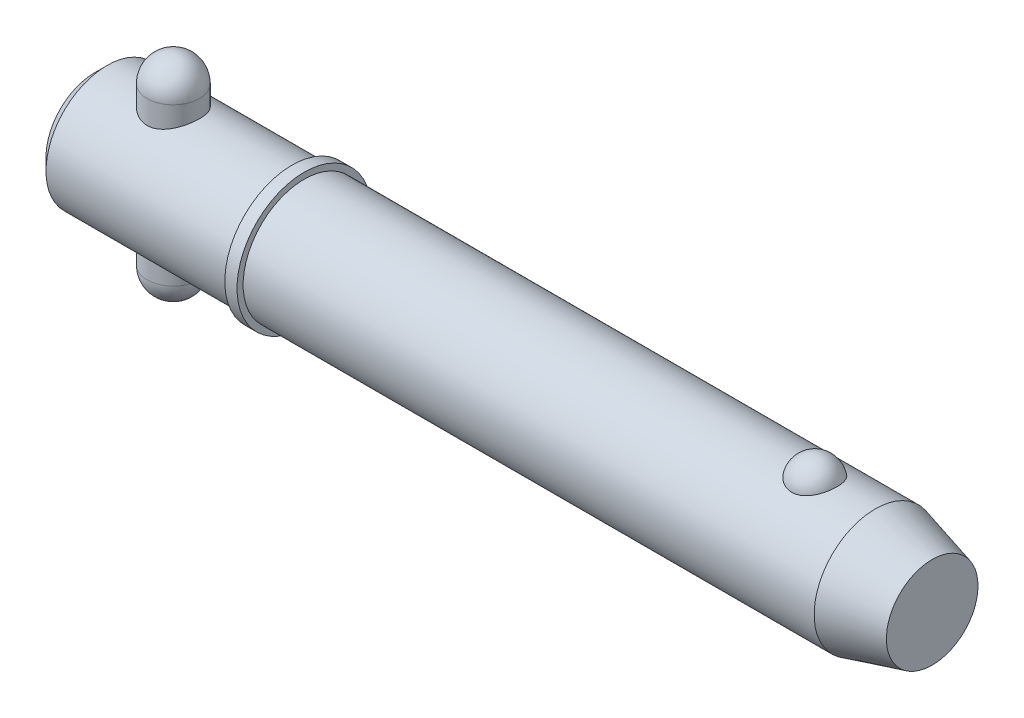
ISO-10303-21;
HEADER;
FILE_DESCRIPTION(('STEP AP214'),'2;1');
FILE_NAME('part.step','',(''),(''),'','','');
FILE_SCHEMA(('AUTOMOTIVE_DESIGN { 1 0 10303 214 1 1 1 1 }'));
ENDSEC;
DATA;
#1=APPLICATION_CONTEXT('core data for automotive mechanical design processes');
#2=APPLICATION_PROTOCOL_DEFINITION('international standard','automotive_design',2000,#1);
#3=PRODUCT_CONTEXT('',#1,'mechanical');
#4=PRODUCT('Part','Part','',(#3));
#5=PRODUCT_RELATED_PRODUCT_CATEGORY('part','',(#4));
#6=PRODUCT_DEFINITION_FORMATION('','',#4);
#7=PRODUCT_DEFINITION_CONTEXT('part definition',#1,'design');
#8=PRODUCT_DEFINITION('design','',#6,#7);
#9=PRODUCT_DEFINITION_SHAPE('','',#8);
#10=(LENGTH_UNIT() NAMED_UNIT(*) SI_UNIT(.MILLI.,.METRE.));
#11=(NAMED_UNIT(*) PLANE_ANGLE_UNIT() SI_UNIT($,.RADIAN.));
#12=(NAMED_UNIT(*) SI_UNIT($,.STERADIAN.) SOLID_ANGLE_UNIT());
#13=UNCERTAINTY_MEASURE_WITH_UNIT(LENGTH_MEASURE(1.E-05),#10,'distance_accuracy_value','');
#14=(GEOMETRIC_REPRESENTATION_CONTEXT(3) GLOBAL_UNCERTAINTY_ASSIGNED_CONTEXT((#13)) GLOBAL_UNIT_ASSIGNED_CONTEXT((#10,
#11,#12)) REPRESENTATION_CONTEXT('',''));
#15=CARTESIAN_POINT('',(0.,0.,0.));
#16=DIRECTION('',(0.,0.,1.));
#17=DIRECTION('',(1.,0.,0.));
#18=AXIS2_PLACEMENT_3D('',#15,#16,#17);
#19=CARTESIAN_POINT('',(14.28,19.05,0.));
#20=DIRECTION('',(0.,-1.,0.));
#21=DIRECTION('',(0.,0.,-1.));
#22=AXIS2_PLACEMENT_3D('',#19,#20,#21);
#23=CYLINDRICAL_SURFACE('',#22,4.76);
#24=CARTESIAN_POINT('',(14.28,-14.29,0.));
#25=DIRECTION('',(0.,-1.,0.));
#26=DIRECTION('',(0.,0.,-1.));
#27=AXIS2_PLACEMENT_3D('',#24,#25,#26);
#28=CIRCLE('',#27,4.76);
#29=CARTESIAN_POINT('',(14.28,-14.29,-4.76));
#30=VERTEX_POINT('',#29);
#31=EDGE_CURVE('P0_E10',#30,#30,#28,.F.);
#32=CARTESIAN_POINT('',(14.28,14.29,0.));
#33=DIRECTION('',(0.,-1.,0.));
#34=DIRECTION('',(0.,0.,-1.));
#35=AXIS2_PLACEMENT_3D('',#32,#33,#34);
#36=CIRCLE('',#35,4.76);
#37=CARTESIAN_POINT('',(14.28,14.29,-4.76));
#38=VERTEX_POINT('',#37);
#39=EDGE_CURVE('P0_E21',#38,#38,#36,.T.);
#40=CARTESIAN_POINT('',(14.28,-14.29,-4.76));
#41=CARTESIAN_POINT('',(14.28,-13.9922916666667,-4.76));
#42=CARTESIAN_POINT('',(14.28,-13.6945833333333,-4.76));
#43=CARTESIAN_POINT('',(14.28,-13.0991666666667,-4.76));
#44=CARTESIAN_POINT('',(14.28,-12.8014583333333,-4.76));
#45=CARTESIAN_POINT('',(14.28,-12.2060416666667,-4.76));
#46=CARTESIAN_POINT('',(14.28,-11.9083333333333,-4.76));
#47=CARTESIAN_POINT('',(14.28,-11.3129166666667,-4.76));
#48=CARTESIAN_POINT('',(14.28,-11.0152083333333,-4.76));
#49=CARTESIAN_POINT('',(14.28,-10.4197916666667,-4.76));
#50=CARTESIAN_POINT('',(14.28,-10.1220833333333,-4.76));
#51=CARTESIAN_POINT('',(14.28,-9.52666666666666,-4.76));
#52=CARTESIAN_POINT('',(14.28,-9.22895833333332,-4.76));
#53=CARTESIAN_POINT('',(14.28,-8.63354166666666,-4.76));
#54=CARTESIAN_POINT('',(14.28,-8.33583333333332,-4.76));
#55=CARTESIAN_POINT('',(14.28,-7.74041666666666,-4.76));
#56=CARTESIAN_POINT('',(14.28,-7.44270833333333,-4.76));
#57=CARTESIAN_POINT('',(14.28,-6.84729166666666,-4.76));
#58=CARTESIAN_POINT('',(14.28,-6.54958333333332,-4.76));
#59=CARTESIAN_POINT('',(14.28,-5.95416666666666,-4.76));
#60=CARTESIAN_POINT('',(14.28,-5.65645833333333,-4.76));
#61=CARTESIAN_POINT('',(14.28,-5.06104166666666,-4.76));
#62=CARTESIAN_POINT('',(14.28,-4.76333333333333,-4.76));
#63=CARTESIAN_POINT('',(14.28,-4.16791666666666,-4.76));
#64=CARTESIAN_POINT('',(14.28,-3.87020833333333,-4.76));
#65=CARTESIAN_POINT('',(14.28,-3.27479166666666,-4.76));
#66=CARTESIAN_POINT('',(14.28,-2.97708333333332,-4.76));
#67=CARTESIAN_POINT('',(14.28,-2.38166666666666,-4.76));
#68=CARTESIAN_POINT('',(14.28,-2.08395833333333,-4.76));
#69=CARTESIAN_POINT('',(14.28,-1.48854166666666,-4.76));
#70=CARTESIAN_POINT('',(14.28,-1.19083333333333,-4.76));
#71=CARTESIAN_POINT('',(14.28,-0.595416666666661,-4.76));
#72=CARTESIAN_POINT('',(14.28,-0.297708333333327,-4.76));
#73=CARTESIAN_POINT('',(14.28,0.297708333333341,-4.76));
#74=CARTESIAN_POINT('',(14.28,0.595416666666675,-4.76));
#75=CARTESIAN_POINT('',(14.28,1.19083333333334,-4.76));
#76=CARTESIAN_POINT('',(14.28,1.48854166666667,-4.76));
#77=CARTESIAN_POINT('',(14.28,2.08395833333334,-4.76));
#78=CARTESIAN_POINT('',(14.28,2.38166666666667,-4.76));
#79=CARTESIAN_POINT('',(14.28,2.97708333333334,-4.76));
#80=CARTESIAN_POINT('',(14.28,3.27479166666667,-4.76));
#81=CARTESIAN_POINT('',(14.28,3.87020833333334,-4.76));
#82=CARTESIAN_POINT('',(14.28,4.16791666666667,-4.76));
#83=CARTESIAN_POINT('',(14.28,4.76333333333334,-4.76));
#84=CARTESIAN_POINT('',(14.28,5.06104166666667,-4.76));
#85=CARTESIAN_POINT('',(14.28,5.65645833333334,-4.76));
#86=CARTESIAN_POINT('',(14.28,5.95416666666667,-4.76));
#87=CARTESIAN_POINT('',(14.28,6.54958333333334,-4.76));
#88=CARTESIAN_POINT('',(14.28,6.84729166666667,-4.76));
#89=CARTESIAN_POINT('',(14.28,7.44270833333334,-4.76));
#90=CARTESIAN_POINT('',(14.28,7.74041666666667,-4.76));
#91=CARTESIAN_POINT('',(14.28,8.33583333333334,-4.76));
#92=CARTESIAN_POINT('',(14.28,8.63354166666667,-4.76));
#93=CARTESIAN_POINT('',(14.28,9.22895833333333,-4.76));
#94=CARTESIAN_POINT('',(14.28,9.52666666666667,-4.76));
#95=CARTESIAN_POINT('',(14.28,10.1220833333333,-4.76));
#96=CARTESIAN_POINT('',(14.28,10.4197916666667,-4.76));
#97=CARTESIAN_POINT('',(14.28,11.0152083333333,-4.76));
#98=CARTESIAN_POINT('',(14.28,11.3129166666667,-4.76));
#99=CARTESIAN_POINT('',(14.28,11.9083333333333,-4.76));
#100=CARTESIAN_POINT('',(14.28,12.2060416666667,-4.76));
#101=CARTESIAN_POINT('',(14.28,12.8014583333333,-4.76));
#102=CARTESIAN_POINT('',(14.28,13.0991666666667,-4.76));
#103=CARTESIAN_POINT('',(14.28,13.6945833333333,-4.76));
#104=CARTESIAN_POINT('',(14.28,13.9922916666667,-4.76));
#105=CARTESIAN_POINT('',(14.28,14.29,-4.76));
#106=B_SPLINE_CURVE_WITH_KNOTS('',3,(#40,#41,#42,#43,#44,#45,#46,#47,#48,#49,#50,#51,#52,#53,
#54,#55,#56,#57,#58,#59,#60,#61,#62,#63,#64,#65,#66,#67,#68,#69,#70,#71,#72,#73,#74,#75,#76,#77,
#78,#79,#80,#81,#82,#83,#84,#85,#86,#87,#88,#89,#90,#91,#92,#93,#94,#95,#96,#97,#98,#99,#100,
#101,#102,#103,#104,#105),.UNSPECIFIED.,.F.,.F.,(4,2,2,2,2,2,2,2,2,2,2,2,2,2,2,2,2,2,2,2,2,2,2,
2,2,2,2,2,2,2,2,2,4),(0.,0.893125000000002,1.78625,2.67937499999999,3.5725,4.465625,5.35875,
6.25187499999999,7.145,8.038125,8.93125,9.82437499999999,10.7175,11.610625,12.50375,13.396875,
14.29,15.183125,16.07625,16.969375,17.8625,18.755625,19.64875,20.541875,21.435,22.328125,
23.22125,24.114375,25.0075,25.900625,26.79375,27.686875,28.58),.UNSPECIFIED.);
#107=EDGE_CURVE('P0_BSEAM14',#30,#38,#106,.T.);
#108=ORIENTED_EDGE('',*,*,#31,.T.);
#109=ORIENTED_EDGE('',*,*,#39,.T.);
#110=ORIENTED_EDGE('',*,*,#107,.T.);
#111=ORIENTED_EDGE('',*,*,#107,.F.);
#112=EDGE_LOOP('',(#108,#110,#109,#111));
#113=FACE_BOUND('',#112,.T.);
#114=ADVANCED_FACE('P0_F14',(#113),#23,.T.);
#115=CARTESIAN_POINT('',(14.28,-14.29,0.));
#116=DIRECTION('',(0.,0.,1.));
#117=DIRECTION('',(1.,0.,0.));
#118=AXIS2_PLACEMENT_3D('',#115,#116,#117);
#119=SPHERICAL_SURFACE('',#118,4.76);
#120=CARTESIAN_POINT('',(14.28,-14.29,0.));
#121=DIRECTION('',(0.,-1.,0.));
#122=DIRECTION('',(0.,0.,-1.));
#123=AXIS2_PLACEMENT_3D('',#120,#121,#122);
#124=SPHERICAL_SURFACE('',#123,4.76);
#125=ORIENTED_EDGE('',*,*,#31,.F.);
#126=EDGE_LOOP('',(#125));
#127=FACE_BOUND('',#126,.T.);
#128=ADVANCED_FACE('P0_F29',(#127),#124,.T.);
#129=CARTESIAN_POINT('',(14.28,14.29,0.));
#130=DIRECTION('',(0.,0.,1.));
#131=DIRECTION('',(1.,0.,0.));
#132=AXIS2_PLACEMENT_3D('',#129,#130,#131);
#133=SPHERICAL_SURFACE('',#132,4.76);
#134=CARTESIAN_POINT('',(14.28,14.29,0.));
#135=DIRECTION('',(0.,-1.,0.));
#136=DIRECTION('',(0.,0.,-1.));
#137=AXIS2_PLACEMENT_3D('',#134,#135,#136);
#138=SPHERICAL_SURFACE('',#137,4.76);
#139=ORIENTED_EDGE('',*,*,#39,.F.);
#140=EDGE_LOOP('',(#139));
#141=FACE_BOUND('',#140,.T.);
#142=ADVANCED_FACE('P0_F16',(#141),#138,.T.);
#143=CLOSED_SHELL('',(#114,#128,#142));
#144=MANIFOLD_SOLID_BREP('P0_B1',#143);
#145=CARTESIAN_POINT('',(0.,0.,0.));
#146=DIRECTION('',(1.,0.,0.));
#147=DIRECTION('',(0.,0.,-1.));
#148=AXIS2_PLACEMENT_3D('',#145,#146,#147);
#149=CYLINDRICAL_SURFACE('',#148,11.115);
#150=CARTESIAN_POINT('',(142.029563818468,0.,0.));
#151=DIRECTION('',(1.,0.,0.));
#152=DIRECTION('',(0.,0.,-1.));
#153=AXIS2_PLACEMENT_3D('',#150,#151,#152);
#154=CIRCLE('',#153,11.115);
#155=CARTESIAN_POINT('',(142.029563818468,0.,-11.115));
#156=VERTEX_POINT('',#155);
#157=EDGE_CURVE('P1_E81',#156,#156,#154,.T.);
#158=ORIENTED_EDGE('',*,*,#157,.F.);
#159=EDGE_LOOP('',(#158));
#160=FACE_BOUND('',#159,.T.);
#161=CARTESIAN_POINT('',(38.1,0.,0.));
#162=DIRECTION('',(1.,0.,0.));
#163=DIRECTION('',(0.,0.,-1.));
#164=AXIS2_PLACEMENT_3D('',#161,#162,#163);
#165=CIRCLE('',#164,11.115);
#166=CARTESIAN_POINT('',(38.1,0.,-11.115));
#167=VERTEX_POINT('',#166);
#168=EDGE_CURVE('P1_E85',#167,#167,#165,.T.);
#169=ORIENTED_EDGE('',*,*,#168,.T.);
#170=EDGE_LOOP('',(#169));
#171=FACE_BOUND('',#170,.T.);
#172=CARTESIAN_POINT('',(131.031068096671,10.3028087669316,4.17077409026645));
#173=CARTESIAN_POINT('',(130.814775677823,10.3028003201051,4.17078240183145));
#174=CARTESIAN_POINT('',(130.598548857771,10.3098895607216,4.15340593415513));
#175=CARTESIAN_POINT('',(130.172540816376,10.3373834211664,4.08449540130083));
#176=CARTESIAN_POINT('',(129.962757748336,10.3577841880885,4.0329712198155));
#177=CARTESIAN_POINT('',(129.555782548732,10.4095237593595,3.89746513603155));
#178=CARTESIAN_POINT('',(129.358572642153,10.4408466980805,3.81353029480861));
#179=CARTESIAN_POINT('',(128.981338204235,10.5110236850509,3.61560339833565));
#180=CARTESIAN_POINT('',(128.801317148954,10.5498792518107,3.50160528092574));
#181=CARTESIAN_POINT('',(128.457684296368,10.6322884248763,3.24292464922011));
#182=CARTESIAN_POINT('',(128.294686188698,10.6759443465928,3.09746040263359));
#183=CARTESIAN_POINT('',(127.994591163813,10.7625291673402,2.7817192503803));
#184=CARTESIAN_POINT('',(127.857499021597,10.8054579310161,2.61143778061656));
#185=CARTESIAN_POINT('',(127.606408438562,10.8881935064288,2.24226695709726));
#186=CARTESIAN_POINT('',(127.493710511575,10.9277761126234,2.04244123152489));
#187=CARTESIAN_POINT('',(127.301777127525,10.997484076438,1.62578254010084));
#188=CARTESIAN_POINT('',(127.222544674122,11.0276085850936,1.40894804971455));
#189=CARTESIAN_POINT('',(127.098303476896,11.0756732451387,0.961250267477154));
#190=CARTESIAN_POINT('',(127.053760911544,11.0934470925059,0.730239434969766));
#191=CARTESIAN_POINT('',(127.001569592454,11.1143331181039,0.263439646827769));
#192=CARTESIAN_POINT('',(126.993920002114,11.1174456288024,0.0276507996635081));
#193=CARTESIAN_POINT('',(127.01561056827,11.1087161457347,-0.440729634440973));
#194=CARTESIAN_POINT('',(127.044762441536,11.0969502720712,-0.6733313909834));
#195=CARTESIAN_POINT('',(127.139143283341,11.0597872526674,-1.12996621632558));
#196=CARTESIAN_POINT('',(127.204372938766,11.0343898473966,-1.35399912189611));
#197=CARTESIAN_POINT('',(127.36969844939,10.972515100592,-1.78750286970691));
#198=CARTESIAN_POINT('',(127.46983863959,10.9360236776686,-1.99695478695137));
#199=CARTESIAN_POINT('',(127.702940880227,10.8557595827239,-2.39520667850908));
#200=CARTESIAN_POINT('',(127.835905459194,10.8119863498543,-2.58400506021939));
#201=CARTESIAN_POINT('',(128.132407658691,10.7216733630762,-2.93635726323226));
#202=CARTESIAN_POINT('',(128.296056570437,10.675123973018,-3.09981510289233));
#203=CARTESIAN_POINT('',(128.649860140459,10.5846571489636,-3.39592247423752));
#204=CARTESIAN_POINT('',(128.840012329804,10.5407394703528,-3.52857487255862));
#205=CARTESIAN_POINT('',(129.23750141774,10.4616690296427,-3.75646057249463));
#206=CARTESIAN_POINT('',(129.44436705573,10.4263443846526,-3.85245432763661));
#207=CARTESIAN_POINT('',(129.872954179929,10.3675574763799,-4.00798747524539));
#208=CARTESIAN_POINT('',(130.094670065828,10.344090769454,-4.0675405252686));
#209=CARTESIAN_POINT('',(130.534669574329,10.3128282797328,-4.14614314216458));
#210=CARTESIAN_POINT('',(130.752565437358,10.3043040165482,-4.1670783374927));
#211=CARTESIAN_POINT('',(131.18894951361,10.3016771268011,-4.17357158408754));
#212=CARTESIAN_POINT('',(131.407437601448,10.3075716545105,-4.15913661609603));
#213=CARTESIAN_POINT('',(131.831744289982,10.3326686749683,-4.09636961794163));
#214=CARTESIAN_POINT('',(132.037745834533,10.3514555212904,-4.0490957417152));
#215=CARTESIAN_POINT('',(132.438576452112,10.399818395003,-3.92320197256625));
#216=CARTESIAN_POINT('',(132.6334046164,10.4293952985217,-3.84457953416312));
#217=CARTESIAN_POINT('',(133.011191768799,10.4969600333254,-3.65612410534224));
#218=CARTESIAN_POINT('',(133.193797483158,10.5351178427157,-3.54564545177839));
#219=CARTESIAN_POINT('',(133.538204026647,10.6154999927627,-3.29718036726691));
#220=CARTESIAN_POINT('',(133.700000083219,10.657725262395,-3.15918764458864));
#221=CARTESIAN_POINT('',(134.006959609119,10.744212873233,-2.85163580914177));
#222=CARTESIAN_POINT('',(134.150891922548,10.7884718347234,-2.68084605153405));
#223=CARTESIAN_POINT('',(134.409237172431,10.872374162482,-2.31721864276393));
#224=CARTESIAN_POINT('',(134.523644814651,10.9120167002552,-2.12437704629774));
#225=CARTESIAN_POINT('',(134.723873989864,10.9838919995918,-1.71516999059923));
#226=CARTESIAN_POINT('',(134.80866178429,11.0158465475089,-1.49824866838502));
#227=CARTESIAN_POINT('',(134.94268382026,11.0673523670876,-1.05228572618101));
#228=CARTESIAN_POINT('',(134.991917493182,11.086903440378,-0.823243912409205));
#229=CARTESIAN_POINT('',(135.053891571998,11.1116323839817,-0.359087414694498));
#230=CARTESIAN_POINT('',(135.066566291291,11.1167843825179,-0.12396256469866));
#231=CARTESIAN_POINT('',(135.054973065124,11.1121144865,0.345220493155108));
#232=CARTESIAN_POINT('',(135.030705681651,11.1022928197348,0.579278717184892));
#233=CARTESIAN_POINT('',(134.945907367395,11.0687504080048,1.03866534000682));
#234=CARTESIAN_POINT('',(134.885529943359,11.0450885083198,1.26402641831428));
#235=CARTESIAN_POINT('',(134.729853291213,10.9863185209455,1.70076772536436));
#236=CARTESIAN_POINT('',(134.634551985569,10.9512097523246,1.91214712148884));
#237=CARTESIAN_POINT('',(134.410397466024,10.8729733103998,2.316083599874));
#238=CARTESIAN_POINT('',(134.281380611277,10.8298068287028,2.50854240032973));
#239=CARTESIAN_POINT('',(133.992732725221,10.7401896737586,2.86808766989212));
#240=CARTESIAN_POINT('',(133.833102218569,10.6937390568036,3.03517457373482));
#241=CARTESIAN_POINT('',(133.487534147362,10.6029321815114,3.33857581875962));
#242=CARTESIAN_POINT('',(133.301708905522,10.5585680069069,3.47501541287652));
#243=CARTESIAN_POINT('',(132.907875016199,10.4769321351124,3.71390897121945));
#244=CARTESIAN_POINT('',(132.699863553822,10.439661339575,3.81635861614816));
#245=CARTESIAN_POINT('',(132.254066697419,10.3749407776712,3.98910631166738));
#246=CARTESIAN_POINT('',(132.015234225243,10.3482457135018,4.05700929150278));
#247=CARTESIAN_POINT('',(131.527925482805,10.312188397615,4.14782844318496));
#248=CARTESIAN_POINT('',(131.279453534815,10.3028184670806,4.17076454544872));
#249=CARTESIAN_POINT('',(131.031068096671,10.3028087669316,4.17077409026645));
#250=B_SPLINE_CURVE_WITH_KNOTS('',3,(#172,#173,#174,#175,#176,#177,#178,#179,#180,#181,#182,
#183,#184,#185,#186,#187,#188,#189,#190,#191,#192,#193,#194,#195,#196,#197,#198,#199,#200,#201,
#202,#203,#204,#205,#206,#207,#208,#209,#210,#211,#212,#213,#214,#215,#216,#217,#218,#219,#220,
#221,#222,#223,#224,#225,#226,#227,#228,#229,#230,#231,#232,#233,#234,#235,#236,#237,#238,#239,
#240,#241,#242,#243,#244,#245,#246,#247,#248,#249),.UNSPECIFIED.,.T.,.F.,(4,2,2,2,2,2,2,2,2,2,2,
2,2,2,2,2,2,2,2,2,2,2,2,2,2,2,2,2,2,2,2,2,2,2,2,2,2,2,4),(0.,0.64796614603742,1.29574482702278,
1.94258643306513,2.58955857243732,3.25496465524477,3.92049326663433,4.61566368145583,
5.31089647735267,6.01531821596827,6.71972398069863,7.42054043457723,8.12137023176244,
8.82309331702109,9.52487047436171,10.2292439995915,10.9335519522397,11.6223330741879,
12.3108558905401,12.9647664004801,13.6185478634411,14.252184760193,14.8858731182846,
15.5334360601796,16.1811472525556,16.8611459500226,17.5412664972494,18.2431855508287,
18.9451158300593,19.6483065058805,20.3514864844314,21.0516982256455,21.7519516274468,
22.4556690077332,23.1593743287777,23.860149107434,24.5610129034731,25.3054529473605,
26.049562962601),.UNSPECIFIED.);
#251=CARTESIAN_POINT('',(131.031068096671,10.3028087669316,4.17077409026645));
#252=VERTEX_POINT('',#251);
#253=EDGE_CURVE('P1_E35',#252,#252,#250,.T.);
#254=ORIENTED_EDGE('',*,*,#253,.T.);
#255=EDGE_LOOP('',(#254));
#256=FACE_BOUND('',#255,.T.);
#257=ADVANCED_FACE('P1_F13',(#160,#171,#256),#149,.T.);
#258=CARTESIAN_POINT('',(0.,0.,0.));
#259=DIRECTION('',(-1.,0.,0.));
#260=DIRECTION('',(0.,0.,1.));
#261=AXIS2_PLACEMENT_3D('',#258,#259,#260);
#262=PLANE('',#261);
#263=CARTESIAN_POINT('',(0.,0.,0.));
#264=DIRECTION('',(1.,0.,0.));
#265=DIRECTION('',(0.,0.,-1.));
#266=AXIS2_PLACEMENT_3D('',#263,#264,#265);
#267=CIRCLE('',#266,8.892);
#268=CARTESIAN_POINT('',(0.,0.,-8.892));
#269=VERTEX_POINT('',#268);
#270=EDGE_CURVE('P1_E9',#269,#269,#267,.T.);
#271=ORIENTED_EDGE('',*,*,#270,.F.);
#272=EDGE_LOOP('',(#271));
#273=FACE_BOUND('',#272,.T.);
#274=ADVANCED_FACE('P1_F15',(#273),#262,.T.);
#275=CARTESIAN_POINT('',(2.22299999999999,0.,0.));
#276=DIRECTION('',(1.,0.,0.));
#277=DIRECTION('',(0.,0.,-1.));
#278=AXIS2_PLACEMENT_3D('',#275,#276,#277);
#279=CONICAL_SURFACE('',#278,11.115,0.78539816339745);
#280=ORIENTED_EDGE('',*,*,#270,.T.);
#281=EDGE_LOOP('',(#280));
#282=FACE_BOUND('',#281,.T.);
#283=CARTESIAN_POINT('',(2.22299999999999,0.,0.));
#284=DIRECTION('',(1.,0.,0.));
#285=DIRECTION('',(0.,0.,-1.));
#286=AXIS2_PLACEMENT_3D('',#283,#284,#285);
#287=CIRCLE('',#286,11.115);
#288=CARTESIAN_POINT('',(2.22299999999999,0.,-11.115));
#289=VERTEX_POINT('',#288);
#290=EDGE_CURVE('P1_E26',#289,#289,#287,.T.);
#291=ORIENTED_EDGE('',*,*,#290,.F.);
#292=EDGE_LOOP('',(#291));
#293=FACE_BOUND('',#292,.T.);
#294=ADVANCED_FACE('P1_F77',(#282,#293),#279,.T.);
#295=CARTESIAN_POINT('',(0.,0.,0.));
#296=DIRECTION('',(1.,0.,0.));
#297=DIRECTION('',(0.,0.,-1.));
#298=AXIS2_PLACEMENT_3D('',#295,#296,#297);
#299=CYLINDRICAL_SURFACE('',#298,11.115);
#300=CARTESIAN_POINT('',(14.28,-10.0441836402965,4.76));
#301=CARTESIAN_POINT('',(14.1533731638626,-10.0441846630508,4.75999904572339));
#302=CARTESIAN_POINT('',(14.0267055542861,-10.0465865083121,4.75493985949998));
#303=CARTESIAN_POINT('',(13.774298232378,-10.0561141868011,4.73475585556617));
#304=CARTESIAN_POINT('',(13.6485591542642,-10.0632429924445,4.71962470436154));
#305=CARTESIAN_POINT('',(13.3987500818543,-10.0819979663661,4.67942666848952));
#306=CARTESIAN_POINT('',(13.2746840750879,-10.0936334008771,4.65433930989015));
#307=CARTESIAN_POINT('',(13.0293244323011,-10.1210146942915,4.59449317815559));
#308=CARTESIAN_POINT('',(12.9080319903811,-10.1367622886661,4.55973032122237));
#309=CARTESIAN_POINT('',(12.669614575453,-10.1717810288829,4.48106435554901));
#310=CARTESIAN_POINT('',(12.5524727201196,-10.1910352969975,4.4372048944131));
#311=CARTESIAN_POINT('',(12.3224300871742,-10.2325403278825,4.34063417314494));
#312=CARTESIAN_POINT('',(12.2095309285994,-10.2547922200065,4.28791957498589));
#313=CARTESIAN_POINT('',(11.8782785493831,-10.3250879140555,4.11715127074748));
#314=CARTESIAN_POINT('',(11.6670799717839,-10.3767168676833,3.98637638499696));
#315=CARTESIAN_POINT('',(11.2564039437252,-10.4874309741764,3.68567149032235));
#316=CARTESIAN_POINT('',(11.0583793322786,-10.5467772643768,3.51386978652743));
#317=CARTESIAN_POINT('',(10.6927724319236,-10.6641377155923,3.13969960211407));
#318=CARTESIAN_POINT('',(10.5252022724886,-10.7221513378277,2.93731900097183));
#319=CARTESIAN_POINT('',(10.2965609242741,-10.8050020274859,2.60935726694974));
#320=CARTESIAN_POINT('',(10.2227768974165,-10.8324811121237,2.49310321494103));
#321=CARTESIAN_POINT('',(10.0853380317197,-10.884703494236,2.25418999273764));
#322=CARTESIAN_POINT('',(10.0216789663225,-10.9094479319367,2.13153352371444));
#323=CARTESIAN_POINT('',(9.90506238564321,-10.9554932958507,1.88060370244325));
#324=CARTESIAN_POINT('',(9.85210574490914,-10.9767939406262,1.7523298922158));
#325=CARTESIAN_POINT('',(9.75746464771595,-11.0153112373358,1.49115740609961));
#326=CARTESIAN_POINT('',(9.71577447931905,-11.0325299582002,1.35826111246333));
#327=CARTESIAN_POINT('',(9.64605475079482,-11.0615607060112,1.09614539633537));
#328=CARTESIAN_POINT('',(9.61740732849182,-11.0736151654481,0.96711700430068));
#329=CARTESIAN_POINT('',(9.57092026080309,-11.0932687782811,0.706847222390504));
#330=CARTESIAN_POINT('',(9.55307574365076,-11.1008699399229,0.575606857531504));
#331=CARTESIAN_POINT('',(9.52838640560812,-11.1114054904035,0.31192917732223));
#332=CARTESIAN_POINT('',(9.52153986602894,-11.114340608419,0.179492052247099));
#333=CARTESIAN_POINT('',(9.51892405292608,-11.1154607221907,-0.0855090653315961));
#334=CARTESIAN_POINT('',(9.52315432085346,-11.1136459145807,-0.218073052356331));
#335=CARTESIAN_POINT('',(9.542009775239,-11.1055891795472,-0.473709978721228));
#336=CARTESIAN_POINT('',(9.55594693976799,-11.099640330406,-0.596843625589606));
#337=CARTESIAN_POINT('',(9.59332832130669,-11.0837823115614,-0.841440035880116));
#338=CARTESIAN_POINT('',(9.61677567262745,-11.0738718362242,-0.962902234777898));
#339=CARTESIAN_POINT('',(9.67294089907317,-11.0503378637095,-1.20325684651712));
#340=CARTESIAN_POINT('',(9.70565569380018,-11.0367156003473,-1.32215009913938));
#341=CARTESIAN_POINT('',(9.78005008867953,-11.0060908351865,-1.55666640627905));
#342=CARTESIAN_POINT('',(9.82173311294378,-10.9890870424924,-1.67228819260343));
#343=CARTESIAN_POINT('',(9.96110379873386,-10.9330280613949,-2.01656166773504));
#344=CARTESIAN_POINT('',(10.0722987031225,-10.8892801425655,-2.23915547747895));
#345=CARTESIAN_POINT('',(10.3268588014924,-10.7934745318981,-2.66299199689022));
#346=CARTESIAN_POINT('',(10.4702355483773,-10.7414138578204,-2.86422700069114));
#347=CARTESIAN_POINT('',(10.7973904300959,-10.6296201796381,-3.25557775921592));
#348=CARTESIAN_POINT('',(10.9833705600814,-10.569604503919,-3.443774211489));
#349=CARTESIAN_POINT('',(11.3844486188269,-10.4514707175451,-3.78722133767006));
#350=CARTESIAN_POINT('',(11.5995590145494,-10.3933534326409,-3.94245783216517));
#351=CARTESIAN_POINT('',(11.9444340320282,-10.311516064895,-4.14990014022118));
#352=CARTESIAN_POINT('',(12.0654579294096,-10.2847012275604,-4.21573894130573));
#353=CARTESIAN_POINT('',(12.3132718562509,-10.2342051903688,-4.33688518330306));
#354=CARTESIAN_POINT('',(12.4400593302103,-10.2105226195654,-4.39219723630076));
#355=CARTESIAN_POINT('',(12.6985418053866,-10.1671237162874,-4.49174500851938));
#356=CARTESIAN_POINT('',(12.8302359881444,-10.1474067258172,-4.53598256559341));
#357=CARTESIAN_POINT('',(13.0975061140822,-10.1126841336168,-4.61287629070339));
#358=CARTESIAN_POINT('',(13.233079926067,-10.0976759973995,-4.64553869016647));
#359=CARTESIAN_POINT('',(13.4978553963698,-10.0737863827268,-4.6971059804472));
#360=CARTESIAN_POINT('',(13.6268754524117,-10.0645618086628,-4.716785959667));
#361=CARTESIAN_POINT('',(13.8862990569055,-10.051062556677,-4.74548419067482));
#362=CARTESIAN_POINT('',(14.0167019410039,-10.0467856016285,-4.75450734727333));
#363=CARTESIAN_POINT('',(14.277859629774,-10.0433352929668,-4.76179143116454));
#364=CARTESIAN_POINT('',(14.4086143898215,-10.0441613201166,-4.76005366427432));
#365=CARTESIAN_POINT('',(14.6694025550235,-10.0508838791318,-4.74584231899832));
#366=CARTESIAN_POINT('',(14.7994359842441,-10.0567802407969,-4.73336910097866));
#367=CARTESIAN_POINT('',(15.0487369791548,-10.0728449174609,-4.69907984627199));
#368=CARTESIAN_POINT('',(15.1681238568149,-10.0826872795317,-4.67797462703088));
#369=CARTESIAN_POINT('',(15.4045894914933,-10.1062580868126,-4.62682977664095));
#370=CARTESIAN_POINT('',(15.5216674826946,-10.1199877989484,-4.59678723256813));
#371=CARTESIAN_POINT('',(15.868278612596,-10.1664161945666,-4.49365911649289));
#372=CARTESIAN_POINT('',(16.0933756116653,-10.2043671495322,-4.40754694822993));
#373=CARTESIAN_POINT('',(16.5357981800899,-10.2919879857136,-4.19898201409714));
#374=CARTESIAN_POINT('',(16.7523611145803,-10.3420954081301,-4.07511281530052));
#375=CARTESIAN_POINT('',(17.1627188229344,-10.4477911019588,-3.7959429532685));
#376=CARTESIAN_POINT('',(17.3565033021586,-10.5033818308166,-3.64062816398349));
#377=CARTESIAN_POINT('',(17.7334034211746,-10.6196376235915,-3.28693729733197));
#378=CARTESIAN_POINT('',(17.9141276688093,-10.6803237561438,-3.08599175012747));
#379=CARTESIAN_POINT('',(18.1582189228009,-10.7666348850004,-2.76320365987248));
#380=CARTESIAN_POINT('',(18.2351223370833,-10.7946346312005,-2.65197124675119));
#381=CARTESIAN_POINT('',(18.3793967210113,-10.8483267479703,-2.42297927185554));
#382=CARTESIAN_POINT('',(18.4467718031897,-10.87402011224,-2.30522255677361));
#383=CARTESIAN_POINT('',(18.5717669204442,-10.9225249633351,-2.06324665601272));
#384=CARTESIAN_POINT('',(18.6293326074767,-10.9453202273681,-1.93899615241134));
#385=CARTESIAN_POINT('',(18.73370006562,-10.9872100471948,-1.6855059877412));
#386=CARTESIAN_POINT('',(18.7805065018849,-11.0063062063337,-1.55626851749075));
#387=CARTESIAN_POINT('',(18.8628731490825,-11.0402419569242,-1.29375150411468));
#388=CARTESIAN_POINT('',(18.8984366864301,-11.0550828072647,-1.16047316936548));
#389=CARTESIAN_POINT('',(18.9579183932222,-11.0800638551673,-0.890912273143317));
#390=CARTESIAN_POINT('',(18.9818374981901,-11.0902044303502,-0.75462995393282));
#391=CARTESIAN_POINT('',(19.0164177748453,-11.104911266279,-0.490295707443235));
#392=CARTESIAN_POINT('',(19.027922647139,-11.1098318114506,-0.362373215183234));
#393=CARTESIAN_POINT('',(19.040554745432,-11.1152360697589,-0.105876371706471));
#394=CARTESIAN_POINT('',(19.0416784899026,-11.1157182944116,0.0226981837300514));
#395=CARTESIAN_POINT('',(19.0335275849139,-11.1122291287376,0.27938352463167));
#396=CARTESIAN_POINT('',(19.0242587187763,-11.1082602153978,0.407494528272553));
#397=CARTESIAN_POINT('',(18.9954320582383,-11.0959792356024,0.662388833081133));
#398=CARTESIAN_POINT('',(18.9758704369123,-11.0876655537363,0.789171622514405));
#399=CARTESIAN_POINT('',(18.9276379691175,-11.0673259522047,1.03545890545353));
#400=CARTESIAN_POINT('',(18.8993573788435,-11.0554596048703,1.15505309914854));
#401=CARTESIAN_POINT('',(18.8337694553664,-11.0282166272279,1.39134516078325));
#402=CARTESIAN_POINT('',(18.7964589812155,-11.0128387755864,1.5080420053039));
#403=CARTESIAN_POINT('',(18.671464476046,-10.9619666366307,1.85262797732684));
#404=CARTESIAN_POINT('',(18.5706772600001,-10.9217161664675,2.07521484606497));
#405=CARTESIAN_POINT('',(18.33202463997,-10.8301378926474,2.51061719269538));
#406=CARTESIAN_POINT('',(18.1926775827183,-10.7783885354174,2.72252375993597));
#407=CARTESIAN_POINT('',(17.8829747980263,-10.669863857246,3.12088015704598));
#408=CARTESIAN_POINT('',(17.7126068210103,-10.6130865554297,3.30731987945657));
#409=CARTESIAN_POINT('',(17.3310036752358,-10.495668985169,3.66358491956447));
#410=CARTESIAN_POINT('',(17.1177010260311,-10.4350471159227,3.83122543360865));
#411=CARTESIAN_POINT('',(16.7778915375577,-10.3495418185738,4.05420569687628));
#412=CARTESIAN_POINT('',(16.6612023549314,-10.3219229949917,4.12383380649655));
#413=CARTESIAN_POINT('',(16.4218466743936,-10.2693487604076,4.25306463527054));
#414=CARTESIAN_POINT('',(16.2991829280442,-10.2443921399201,4.31267191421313));
#415=CARTESIAN_POINT('',(16.0488008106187,-10.1979981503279,4.42126071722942));
#416=CARTESIAN_POINT('',(15.9210894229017,-10.1765561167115,4.47025635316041));
#417=CARTESIAN_POINT('',(15.6613937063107,-10.1379191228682,4.55720152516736));
#418=CARTESIAN_POINT('',(15.5294115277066,-10.1207220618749,4.59515652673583));
#419=CARTESIAN_POINT('',(15.2624981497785,-10.091252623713,4.65951684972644));
#420=CARTESIAN_POINT('',(15.1275757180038,-10.0789672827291,4.68595259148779));
#421=CARTESIAN_POINT('',(14.8556442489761,-10.0597530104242,4.72706206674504));
#422=CARTESIAN_POINT('',(14.7186368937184,-10.0528199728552,4.74174481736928));
#423=CARTESIAN_POINT('',(14.5310955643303,-10.047196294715,4.75363843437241));
#424=CARTESIAN_POINT('',(14.48091543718,-10.0460674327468,4.75602323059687));
#425=CARTESIAN_POINT('',(14.3804923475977,-10.044560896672,4.7592042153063));
#426=CARTESIAN_POINT('',(14.3302493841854,-10.0441832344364,4.76000037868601));
#427=CARTESIAN_POINT('',(14.28,-10.0441836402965,4.76));
#428=B_SPLINE_CURVE_WITH_KNOTS('',3,(#300,#301,#302,#303,#304,#305,#306,#307,#308,#309,#310,
#311,#312,#313,#314,#315,#316,#317,#318,#319,#320,#321,#322,#323,#324,#325,#326,#327,#328,#329,
#330,#331,#332,#333,#334,#335,#336,#337,#338,#339,#340,#341,#342,#343,#344,#345,#346,#347,#348,
#349,#350,#351,#352,#353,#354,#355,#356,#357,#358,#359,#360,#361,#362,#363,#364,#365,#366,#367,
#368,#369,#370,#371,#372,#373,#374,#375,#376,#377,#378,#379,#380,#381,#382,#383,#384,#385,#386,
#387,#388,#389,#390,#391,#392,#393,#394,#395,#396,#397,#398,#399,#400,#401,#402,#403,#404,#405,
#406,#407,#408,#409,#410,#411,#412,#413,#414,#415,#416,#417,#418,#419,#420,#421,#422,#423,#424,
#425,#426,#427),.UNSPECIFIED.,.T.,.F.,(4,2,2,2,2,2,2,2,2,2,2,2,2,2,2,2,2,2,2,2,2,2,2,2,2,2,2,2,
2,2,2,2,2,2,2,2,2,2,2,2,2,2,2,2,2,2,2,2,2,2,2,2,2,2,2,2,2,2,2,2,2,2,2,4),(0.,0.379828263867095,
0.759895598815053,1.14074858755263,1.52176256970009,1.90098898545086,2.28035867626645,
3.03818035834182,3.84125131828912,4.6446414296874,5.06541657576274,5.48601561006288,
5.90664899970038,6.3270687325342,6.72470503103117,7.12216187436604,7.51955659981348,
7.91693487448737,8.28868404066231,8.66055582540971,9.03230414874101,9.40419465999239,
10.1585834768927,10.9132435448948,11.7236471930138,12.5343987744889,12.9550196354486,
13.3754557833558,13.7958221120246,14.2159617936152,14.6079540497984,14.9997658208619,
15.3915300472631,15.7832811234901,16.1477615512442,16.512360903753,17.240999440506,
18.0012974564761,18.761937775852,19.5886929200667,20.0025782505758,20.4162843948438,
20.832212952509,21.2479608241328,21.6635855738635,22.0791769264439,22.4642880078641,
22.8495282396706,23.2345541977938,23.6197234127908,23.9896813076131,24.3597680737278,
25.099327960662,25.8726239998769,26.6462260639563,27.4759193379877,27.8914891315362,
28.3068693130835,28.7216936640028,29.1363123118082,29.5498292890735,29.9630287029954,
30.113753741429,30.2644811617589),.UNSPECIFIED.);
#429=CARTESIAN_POINT('',(14.28,-10.0441836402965,4.76));
#430=VERTEX_POINT('',#429);
#431=EDGE_CURVE('P1_E17',#430,#430,#428,.T.);
#432=ORIENTED_EDGE('',*,*,#431,.F.);
#433=EDGE_LOOP('',(#432));
#434=FACE_BOUND('',#433,.T.);
#435=CARTESIAN_POINT('',(14.28,10.0441836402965,4.76));
#436=CARTESIAN_POINT('',(14.4066268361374,10.0441846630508,4.75999904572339));
#437=CARTESIAN_POINT('',(14.5332944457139,10.0465865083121,4.75493985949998));
#438=CARTESIAN_POINT('',(14.785701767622,10.0561141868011,4.73475585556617));
#439=CARTESIAN_POINT('',(14.9114408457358,10.0632429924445,4.71962470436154));
#440=CARTESIAN_POINT('',(15.1612499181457,10.0819979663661,4.67942666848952));
#441=CARTESIAN_POINT('',(15.2853159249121,10.0936334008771,4.65433930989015));
#442=CARTESIAN_POINT('',(15.5306755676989,10.1210146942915,4.59449317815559));
#443=CARTESIAN_POINT('',(15.6519680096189,10.1367622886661,4.55973032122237));
#444=CARTESIAN_POINT('',(15.890385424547,10.1717810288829,4.48106435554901));
#445=CARTESIAN_POINT('',(16.0075272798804,10.1910352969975,4.4372048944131));
#446=CARTESIAN_POINT('',(16.2375699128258,10.2325403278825,4.34063417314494));
#447=CARTESIAN_POINT('',(16.3504690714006,10.2547922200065,4.28791957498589));
#448=CARTESIAN_POINT('',(16.6817214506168,10.3250879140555,4.11715127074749));
#449=CARTESIAN_POINT('',(16.8929200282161,10.3767168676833,3.98637638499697));
#450=CARTESIAN_POINT('',(17.3035960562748,10.4874309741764,3.68567149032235));
#451=CARTESIAN_POINT('',(17.5016206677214,10.5467772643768,3.51386978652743));
#452=CARTESIAN_POINT('',(17.8672275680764,10.6641377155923,3.13969960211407));
#453=CARTESIAN_POINT('',(18.0347977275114,10.7221513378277,2.93731900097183));
#454=CARTESIAN_POINT('',(18.2634390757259,10.8050020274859,2.60935726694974));
#455=CARTESIAN_POINT('',(18.3372231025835,10.8324811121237,2.49310321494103));
#456=CARTESIAN_POINT('',(18.4746619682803,10.884703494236,2.25418999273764));
#457=CARTESIAN_POINT('',(18.5383210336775,10.9094479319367,2.13153352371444));
#458=CARTESIAN_POINT('',(18.6549376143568,10.9554932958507,1.88060370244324));
#459=CARTESIAN_POINT('',(18.7078942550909,10.9767939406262,1.75232989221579));
#460=CARTESIAN_POINT('',(18.8025353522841,11.0153112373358,1.4911574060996));
#461=CARTESIAN_POINT('',(18.844225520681,11.0325299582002,1.35826111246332));
#462=CARTESIAN_POINT('',(18.9139452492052,11.0615607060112,1.09614539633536));
#463=CARTESIAN_POINT('',(18.9425926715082,11.0736151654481,0.967117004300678));
#464=CARTESIAN_POINT('',(18.9890797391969,11.0932687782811,0.706847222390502));
#465=CARTESIAN_POINT('',(19.0069242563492,11.1008699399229,0.575606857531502));
#466=CARTESIAN_POINT('',(19.0316135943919,11.1114054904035,0.311929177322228));
#467=CARTESIAN_POINT('',(19.0384601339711,11.114340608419,0.179492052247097));
#468=CARTESIAN_POINT('',(19.0410759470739,11.1154607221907,-0.0855090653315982));
#469=CARTESIAN_POINT('',(19.0368456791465,11.1136459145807,-0.218073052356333));
#470=CARTESIAN_POINT('',(19.017990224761,11.1055891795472,-0.47370997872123));
#471=CARTESIAN_POINT('',(19.004053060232,11.099640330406,-0.596843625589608));
#472=CARTESIAN_POINT('',(18.9666716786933,11.0837823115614,-0.841440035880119));
#473=CARTESIAN_POINT('',(18.9432243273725,11.0738718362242,-0.9629022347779));
#474=CARTESIAN_POINT('',(18.8870591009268,11.0503378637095,-1.20325684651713));
#475=CARTESIAN_POINT('',(18.8543443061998,11.0367156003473,-1.32215009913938));
#476=CARTESIAN_POINT('',(18.7799499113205,11.0060908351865,-1.55666640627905));
#477=CARTESIAN_POINT('',(18.7382668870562,10.9890870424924,-1.67228819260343));
#478=CARTESIAN_POINT('',(18.5988962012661,10.9330280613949,-2.01656166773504));
#479=CARTESIAN_POINT('',(18.4877012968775,10.8892801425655,-2.23915547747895));
#480=CARTESIAN_POINT('',(18.2331411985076,10.7934745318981,-2.66299199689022));
#481=CARTESIAN_POINT('',(18.0897644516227,10.7414138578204,-2.86422700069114));
#482=CARTESIAN_POINT('',(17.7626095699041,10.6296201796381,-3.25557775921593));
#483=CARTESIAN_POINT('',(17.5766294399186,10.569604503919,-3.443774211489));
#484=CARTESIAN_POINT('',(17.1755513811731,10.4514707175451,-3.78722133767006));
#485=CARTESIAN_POINT('',(16.9604409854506,10.3933534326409,-3.94245783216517));
#486=CARTESIAN_POINT('',(16.6155659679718,10.311516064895,-4.14990014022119));
#487=CARTESIAN_POINT('',(16.4945420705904,10.2847012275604,-4.21573894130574));
#488=CARTESIAN_POINT('',(16.2467281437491,10.2342051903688,-4.33688518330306));
#489=CARTESIAN_POINT('',(16.1199406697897,10.2105226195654,-4.39219723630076));
#490=CARTESIAN_POINT('',(15.8614581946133,10.1671237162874,-4.49174500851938));
#491=CARTESIAN_POINT('',(15.7297640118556,10.1474067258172,-4.53598256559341));
#492=CARTESIAN_POINT('',(15.4624938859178,10.1126841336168,-4.61287629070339));
#493=CARTESIAN_POINT('',(15.326920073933,10.0976759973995,-4.64553869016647));
#494=CARTESIAN_POINT('',(15.0621446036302,10.0737863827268,-4.6971059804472));
#495=CARTESIAN_POINT('',(14.9331245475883,10.0645618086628,-4.716785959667));
#496=CARTESIAN_POINT('',(14.6737009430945,10.051062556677,-4.74548419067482));
#497=CARTESIAN_POINT('',(14.543298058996,10.0467856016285,-4.75450734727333));
#498=CARTESIAN_POINT('',(14.2821403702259,10.0433352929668,-4.76179143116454));
#499=CARTESIAN_POINT('',(14.1513856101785,10.0441613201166,-4.76005366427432));
#500=CARTESIAN_POINT('',(13.8905974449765,10.0508838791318,-4.74584231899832));
#501=CARTESIAN_POINT('',(13.7605640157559,10.0567802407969,-4.73336910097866));
#502=CARTESIAN_POINT('',(13.5112630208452,10.0728449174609,-4.69907984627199));
#503=CARTESIAN_POINT('',(13.3918761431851,10.0826872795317,-4.67797462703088));
#504=CARTESIAN_POINT('',(13.1554105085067,10.1062580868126,-4.62682977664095));
#505=CARTESIAN_POINT('',(13.0383325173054,10.1199877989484,-4.59678723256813));
#506=CARTESIAN_POINT('',(12.691721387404,10.1664161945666,-4.49365911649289));
#507=CARTESIAN_POINT('',(12.4666243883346,10.2043671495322,-4.40754694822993));
#508=CARTESIAN_POINT('',(12.0242018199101,10.2919879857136,-4.19898201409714));
#509=CARTESIAN_POINT('',(11.8076388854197,10.3420954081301,-4.07511281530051));
#510=CARTESIAN_POINT('',(11.3972811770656,10.4477911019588,-3.7959429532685));
#511=CARTESIAN_POINT('',(11.2034966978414,10.5033818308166,-3.64062816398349));
#512=CARTESIAN_POINT('',(10.8265965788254,10.6196376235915,-3.28693729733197));
#513=CARTESIAN_POINT('',(10.6458723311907,10.6803237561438,-3.08599175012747));
#514=CARTESIAN_POINT('',(10.4017810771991,10.7666348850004,-2.76320365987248));
#515=CARTESIAN_POINT('',(10.3248776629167,10.7946346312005,-2.65197124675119));
#516=CARTESIAN_POINT('',(10.1806032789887,10.8483267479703,-2.42297927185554));
#517=CARTESIAN_POINT('',(10.1132281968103,10.87402011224,-2.30522255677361));
#518=CARTESIAN_POINT('',(9.98823307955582,10.9225249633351,-2.06324665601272));
#519=CARTESIAN_POINT('',(9.93066739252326,10.9453202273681,-1.93899615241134));
#520=CARTESIAN_POINT('',(9.82629993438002,10.9872100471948,-1.6855059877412));
#521=CARTESIAN_POINT('',(9.77949349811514,11.0063062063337,-1.55626851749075));
#522=CARTESIAN_POINT('',(9.69712685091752,11.0402419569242,-1.29375150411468));
#523=CARTESIAN_POINT('',(9.66156331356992,11.0550828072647,-1.16047316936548));
#524=CARTESIAN_POINT('',(9.60208160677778,11.0800638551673,-0.890912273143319));
#525=CARTESIAN_POINT('',(9.57816250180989,11.0902044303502,-0.754629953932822));
#526=CARTESIAN_POINT('',(9.54358222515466,11.104911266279,-0.490295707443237));
#527=CARTESIAN_POINT('',(9.53207735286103,11.1098318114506,-0.362373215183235));
#528=CARTESIAN_POINT('',(9.51944525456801,11.1152360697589,-0.105876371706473));
#529=CARTESIAN_POINT('',(9.51832151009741,11.1157182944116,0.0226981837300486));
#530=CARTESIAN_POINT('',(9.52647241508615,11.1122291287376,0.279383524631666));
#531=CARTESIAN_POINT('',(9.53574128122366,11.1082602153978,0.407494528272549));
#532=CARTESIAN_POINT('',(9.5645679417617,11.0959792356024,0.662388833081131));
#533=CARTESIAN_POINT('',(9.58412956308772,11.0876655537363,0.789171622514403));
#534=CARTESIAN_POINT('',(9.63236203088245,11.0673259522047,1.03545890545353));
#535=CARTESIAN_POINT('',(9.66064262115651,11.0554596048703,1.15505309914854));
#536=CARTESIAN_POINT('',(9.72623054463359,11.0282166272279,1.39134516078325));
#537=CARTESIAN_POINT('',(9.76354101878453,11.0128387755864,1.5080420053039));
#538=CARTESIAN_POINT('',(9.88853552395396,10.9619666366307,1.85262797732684));
#539=CARTESIAN_POINT('',(9.98932273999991,10.9217161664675,2.07521484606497));
#540=CARTESIAN_POINT('',(10.22797536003,10.8301378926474,2.51061719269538));
#541=CARTESIAN_POINT('',(10.3673224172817,10.7783885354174,2.72252375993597));
#542=CARTESIAN_POINT('',(10.6770252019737,10.669863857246,3.12088015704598));
#543=CARTESIAN_POINT('',(10.8473931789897,10.6130865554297,3.30731987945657));
#544=CARTESIAN_POINT('',(11.2289963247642,10.495668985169,3.66358491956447));
#545=CARTESIAN_POINT('',(11.4422989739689,10.4350471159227,3.83122543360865));
#546=CARTESIAN_POINT('',(11.7821084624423,10.3495418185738,4.05420569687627));
#547=CARTESIAN_POINT('',(11.8987976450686,10.3219229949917,4.12383380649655));
#548=CARTESIAN_POINT('',(12.1381533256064,10.2693487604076,4.25306463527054));
#549=CARTESIAN_POINT('',(12.2608170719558,10.2443921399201,4.31267191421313));
#550=CARTESIAN_POINT('',(12.5111991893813,10.1979981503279,4.42126071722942));
#551=CARTESIAN_POINT('',(12.6389105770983,10.1765561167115,4.47025635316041));
#552=CARTESIAN_POINT('',(12.8986062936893,10.1379191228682,4.55720152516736));
#553=CARTESIAN_POINT('',(13.0305884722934,10.1207220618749,4.59515652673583));
#554=CARTESIAN_POINT('',(13.2975018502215,10.091252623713,4.65951684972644));
#555=CARTESIAN_POINT('',(13.4324242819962,10.0789672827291,4.68595259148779));
#556=CARTESIAN_POINT('',(13.7043557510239,10.0597530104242,4.72706206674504));
#557=CARTESIAN_POINT('',(13.8413631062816,10.0528199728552,4.74174481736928));
#558=CARTESIAN_POINT('',(14.0289044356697,10.047196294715,4.75363843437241));
#559=CARTESIAN_POINT('',(14.07908456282,10.0460674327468,4.75602323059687));
#560=CARTESIAN_POINT('',(14.1795076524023,10.044560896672,4.7592042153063));
#561=CARTESIAN_POINT('',(14.2297506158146,10.0441832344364,4.76000037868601));
#562=CARTESIAN_POINT('',(14.28,10.0441836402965,4.76));
#563=B_SPLINE_CURVE_WITH_KNOTS('',3,(#435,#436,#437,#438,#439,#440,#441,#442,#443,#444,#445,
#446,#447,#448,#449,#450,#451,#452,#453,#454,#455,#456,#457,#458,#459,#460,#461,#462,#463,#464,
#465,#466,#467,#468,#469,#470,#471,#472,#473,#474,#475,#476,#477,#478,#479,#480,#481,#482,#483,
#484,#485,#486,#487,#488,#489,#490,#491,#492,#493,#494,#495,#496,#497,#498,#499,#500,#501,#502,
#503,#504,#505,#506,#507,#508,#509,#510,#511,#512,#513,#514,#515,#516,#517,#518,#519,#520,#521,
#522,#523,#524,#525,#526,#527,#528,#529,#530,#531,#532,#533,#534,#535,#536,#537,#538,#539,#540,
#541,#542,#543,#544,#545,#546,#547,#548,#549,#550,#551,#552,#553,#554,#555,#556,#557,#558,#559,
#560,#561,#562),.UNSPECIFIED.,.T.,.F.,(4,2,2,2,2,2,2,2,2,2,2,2,2,2,2,2,2,2,2,2,2,2,2,2,2,2,2,2,
2,2,2,2,2,2,2,2,2,2,2,2,2,2,2,2,2,2,2,2,2,2,2,2,2,2,2,2,2,2,2,2,2,2,2,4),(0.,0.379828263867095,
0.759895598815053,1.14074858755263,1.52176256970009,1.90098898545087,2.28035867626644,
3.03818035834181,3.84125131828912,4.6446414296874,5.06541657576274,5.48601561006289,
5.90664899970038,6.3270687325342,6.72470503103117,7.12216187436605,7.51955659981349,
7.91693487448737,8.28868404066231,8.66055582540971,9.03230414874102,9.4041946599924,
10.1585834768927,10.9132435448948,11.7236471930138,12.5343987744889,12.9550196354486,
13.3754557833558,13.7958221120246,14.2159617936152,14.6079540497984,14.9997658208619,
15.3915300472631,15.7832811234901,16.1477615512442,16.512360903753,17.240999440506,
18.0012974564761,18.761937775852,19.5886929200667,20.0025782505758,20.4162843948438,
20.832212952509,21.2479608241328,21.6635855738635,22.0791769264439,22.4642880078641,
22.8495282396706,23.2345541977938,23.6197234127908,23.9896813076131,24.3597680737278,
25.099327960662,25.8726239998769,26.6462260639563,27.4759193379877,27.8914891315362,
28.3068693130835,28.7216936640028,29.1363123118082,29.5498292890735,29.9630287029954,
30.113753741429,30.2644811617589),.UNSPECIFIED.);
#564=CARTESIAN_POINT('',(14.28,10.0441836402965,4.76));
#565=VERTEX_POINT('',#564);
#566=EDGE_CURVE('P1_E43',#565,#565,#563,.T.);
#567=ORIENTED_EDGE('',*,*,#566,.F.);
#568=EDGE_LOOP('',(#567));
#569=FACE_BOUND('',#568,.T.);
#570=ORIENTED_EDGE('',*,*,#290,.T.);
#571=EDGE_LOOP('',(#570));
#572=FACE_BOUND('',#571,.T.);
#573=CARTESIAN_POINT('',(35.877,0.,0.));
#574=DIRECTION('',(1.,0.,0.));
#575=DIRECTION('',(0.,0.,-1.));
#576=AXIS2_PLACEMENT_3D('',#573,#574,#575);
#577=CIRCLE('',#576,11.115);
#578=CARTESIAN_POINT('',(35.877,0.,-11.115));
#579=VERTEX_POINT('',#578);
#580=EDGE_CURVE('P1_E31',#579,#579,#577,.T.);
#581=ORIENTED_EDGE('',*,*,#580,.F.);
#582=EDGE_LOOP('',(#581));
#583=FACE_BOUND('',#582,.T.);
#584=ADVANCED_FACE('P1_F103',(#434,#569,#572,#583),#299,.T.);
#585=CARTESIAN_POINT('',(35.877,11.115,0.));
#586=DIRECTION('',(-1.,0.,0.));
#587=DIRECTION('',(0.,0.,1.));
#588=AXIS2_PLACEMENT_3D('',#585,#586,#587);
#589=PLANE('',#588);
#590=ORIENTED_EDGE('',*,*,#580,.T.);
#591=EDGE_LOOP('',(#590));
#592=FACE_BOUND('',#591,.T.);
#593=CARTESIAN_POINT('',(35.877,0.,0.));
#594=DIRECTION('',(1.,0.,0.));
#595=DIRECTION('',(0.,0.,-1.));
#596=AXIS2_PLACEMENT_3D('',#593,#594,#595);
#597=CIRCLE('',#596,12.2265);
#598=CARTESIAN_POINT('',(35.877,0.,-12.2265));
#599=VERTEX_POINT('',#598);
#600=EDGE_CURVE('P1_E91',#599,#599,#597,.T.);
#601=ORIENTED_EDGE('',*,*,#600,.F.);
#602=EDGE_LOOP('',(#601));
#603=FACE_BOUND('',#602,.T.);
#604=ADVANCED_FACE('P1_F100',(#592,#603),#589,.T.);
#605=CARTESIAN_POINT('',(0.,0.,0.));
#606=DIRECTION('',(1.,0.,0.));
#607=DIRECTION('',(0.,0.,-1.));
#608=AXIS2_PLACEMENT_3D('',#605,#606,#607);
#609=CYLINDRICAL_SURFACE('',#608,12.2265);
#610=ORIENTED_EDGE('',*,*,#600,.T.);
#611=EDGE_LOOP('',(#610));
#612=FACE_BOUND('',#611,.T.);
#613=CARTESIAN_POINT('',(38.1,0.,0.));
#614=DIRECTION('',(1.,0.,0.));
#615=DIRECTION('',(0.,0.,-1.));
#616=AXIS2_PLACEMENT_3D('',#613,#614,#615);
#617=CIRCLE('',#616,12.2265);
#618=CARTESIAN_POINT('',(38.1,0.,-12.2265));
#619=VERTEX_POINT('',#618);
#620=EDGE_CURVE('P1_E88',#619,#619,#617,.T.);
#621=ORIENTED_EDGE('',*,*,#620,.F.);
#622=EDGE_LOOP('',(#621));
#623=FACE_BOUND('',#622,.T.);
#624=ADVANCED_FACE('P1_F68',(#612,#623),#609,.T.);
#625=CARTESIAN_POINT('',(38.1,12.2265,0.));
#626=DIRECTION('',(1.,0.,0.));
#627=DIRECTION('',(0.,0.,-1.));
#628=AXIS2_PLACEMENT_3D('',#625,#626,#627);
#629=PLANE('',#628);
#630=ORIENTED_EDGE('',*,*,#620,.T.);
#631=EDGE_LOOP('',(#630));
#632=FACE_BOUND('',#631,.T.);
#633=ORIENTED_EDGE('',*,*,#168,.F.);
#634=EDGE_LOOP('',(#633));
#635=FACE_BOUND('',#634,.T.);
#636=ADVANCED_FACE('P1_F62',(#632,#635),#629,.T.);
#637=CARTESIAN_POINT('',(152.4,0.,0.));
#638=DIRECTION('',(-1.,0.,0.));
#639=DIRECTION('',(0.,0.,1.));
#640=AXIS2_PLACEMENT_3D('',#637,#638,#639);
#641=CONICAL_SURFACE('',#640,8.33625000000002,0.26179938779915);
#642=ORIENTED_EDGE('',*,*,#157,.T.);
#643=EDGE_LOOP('',(#642));
#644=FACE_BOUND('',#643,.T.);
#645=CARTESIAN_POINT('',(152.4,0.,0.));
#646=DIRECTION('',(1.,0.,0.));
#647=DIRECTION('',(0.,0.,-1.));
#648=AXIS2_PLACEMENT_3D('',#645,#646,#647);
#649=CIRCLE('',#648,8.33625000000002);
#650=CARTESIAN_POINT('',(152.4,0.,-8.33625000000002));
#651=VERTEX_POINT('',#650);
#652=EDGE_CURVE('P1_E42',#651,#651,#649,.T.);
#653=ORIENTED_EDGE('',*,*,#652,.F.);
#654=EDGE_LOOP('',(#653));
#655=FACE_BOUND('',#654,.T.);
#656=ADVANCED_FACE('P1_F59',(#644,#655),#641,.T.);
#657=CARTESIAN_POINT('',(152.4,8.33625000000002,0.));
#658=DIRECTION('',(1.,0.,0.));
#659=DIRECTION('',(0.,0.,-1.));
#660=AXIS2_PLACEMENT_3D('',#657,#658,#659);
#661=PLANE('',#660);
#662=ORIENTED_EDGE('',*,*,#652,.T.);
#663=EDGE_LOOP('',(#662));
#664=FACE_BOUND('',#663,.T.);
#665=ADVANCED_FACE('P1_F55',(#664),#661,.T.);
#666=CARTESIAN_POINT('',(131.031068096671,10.0035,0.));
#667=DIRECTION('',(-1.,0.,0.));
#668=DIRECTION('',(0.,1.,0.));
#669=AXIS2_PLACEMENT_3D('',#666,#667,#668);
#670=SPHERICAL_SURFACE('',#669,4.18150000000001);
#671=ORIENTED_EDGE('',*,*,#253,.F.);
#672=EDGE_LOOP('',(#671));
#673=FACE_BOUND('',#672,.T.);
#674=ADVANCED_FACE('P1_F50',(#673),#670,.T.);
#675=CARTESIAN_POINT('',(14.28,-12.2265,0.));
#676=DIRECTION('',(0.,1.,0.));
#677=DIRECTION('',(0.,0.,1.));
#678=AXIS2_PLACEMENT_3D('',#675,#676,#677);
#679=CYLINDRICAL_SURFACE('',#678,4.76);
#680=ORIENTED_EDGE('',*,*,#431,.T.);
#681=EDGE_LOOP('',(#680));
#682=FACE_BOUND('',#681,.T.);
#683=ORIENTED_EDGE('',*,*,#566,.T.);
#684=EDGE_LOOP('',(#683));
#685=FACE_BOUND('',#684,.T.);
#686=ADVANCED_FACE('P1_F54',(#682,#685),#679,.F.);
#687=CLOSED_SHELL('',(#257,#274,#294,#584,#604,#624,#636,#656,#665,#674,#686));
#688=MANIFOLD_SOLID_BREP('P1_B1',#687);
#689=ADVANCED_BREP_SHAPE_REPRESENTATION('',(#18,#144,#688),#14);
#690=SHAPE_DEFINITION_REPRESENTATION(#9,#689);
ENDSEC;
END-ISO-10303-21;
